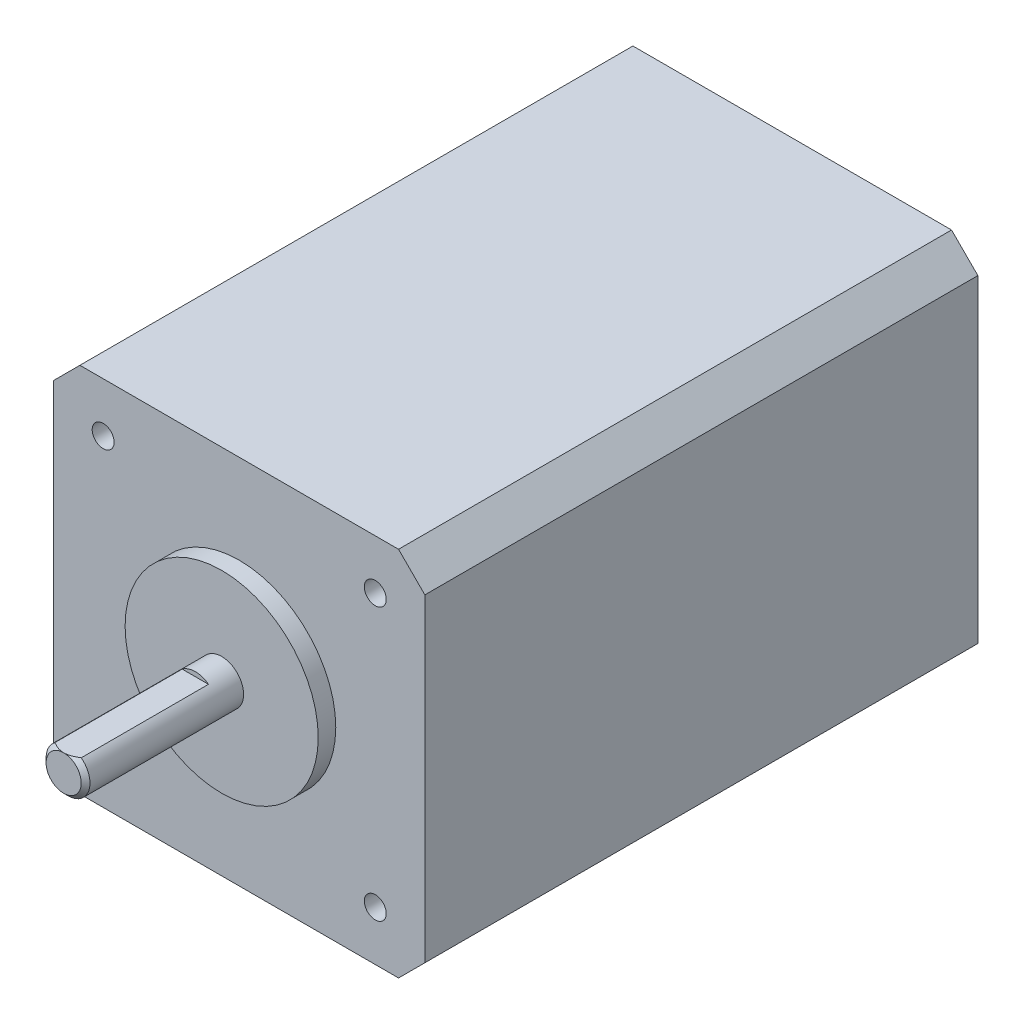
ISO-10303-21;
HEADER;
FILE_DESCRIPTION(('STEP AP214'),'2;1');
FILE_NAME('part.step','',(''),(''),'','','');
FILE_SCHEMA(('AUTOMOTIVE_DESIGN { 1 0 10303 214 1 1 1 1 }'));
ENDSEC;
DATA;
#1=APPLICATION_CONTEXT('core data for automotive mechanical design processes');
#2=APPLICATION_PROTOCOL_DEFINITION('international standard','automotive_design',2000,#1);
#3=PRODUCT_CONTEXT('',#1,'mechanical');
#4=PRODUCT('Part','Part','',(#3));
#5=PRODUCT_RELATED_PRODUCT_CATEGORY('part','',(#4));
#6=PRODUCT_DEFINITION_FORMATION('','',#4);
#7=PRODUCT_DEFINITION_CONTEXT('part definition',#1,'design');
#8=PRODUCT_DEFINITION('design','',#6,#7);
#9=PRODUCT_DEFINITION_SHAPE('','',#8);
#10=(LENGTH_UNIT() NAMED_UNIT(*) SI_UNIT(.MILLI.,.METRE.));
#11=(NAMED_UNIT(*) PLANE_ANGLE_UNIT() SI_UNIT($,.RADIAN.));
#12=(NAMED_UNIT(*) SI_UNIT($,.STERADIAN.) SOLID_ANGLE_UNIT());
#13=UNCERTAINTY_MEASURE_WITH_UNIT(LENGTH_MEASURE(1.E-05),#10,'distance_accuracy_value','');
#14=(GEOMETRIC_REPRESENTATION_CONTEXT(3) GLOBAL_UNCERTAINTY_ASSIGNED_CONTEXT((#13)) GLOBAL_UNIT_ASSIGNED_CONTEXT((#10,
#11,#12)) REPRESENTATION_CONTEXT('',''));
#15=CARTESIAN_POINT('',(0.,0.,0.));
#16=DIRECTION('',(0.,0.,1.));
#17=DIRECTION('',(1.,0.,0.));
#18=AXIS2_PLACEMENT_3D('',#15,#16,#17);
#19=CARTESIAN_POINT('',(0.,0.,0.));
#20=DIRECTION('',(0.,0.,1.));
#21=DIRECTION('',(1.,0.,0.));
#22=AXIS2_PLACEMENT_3D('',#19,#20,#21);
#23=PLANE('',#22);
#24=CARTESIAN_POINT('',(0.,0.,0.));
#25=DIRECTION('',(0.,0.,1.));
#26=DIRECTION('',(1.,0.,0.));
#27=AXIS2_PLACEMENT_3D('',#24,#25,#26);
#28=CIRCLE('',#27,11.);
#29=CARTESIAN_POINT('',(11.,0.,0.));
#30=VERTEX_POINT('',#29);
#31=EDGE_CURVE('E230',#30,#30,#28,.T.);
#32=ORIENTED_EDGE('',*,*,#31,.T.);
#33=EDGE_LOOP('',(#32));
#34=FACE_BOUND('',#33,.T.);
#35=CARTESIAN_POINT('',(0.,0.,0.));
#36=DIRECTION('',(0.,0.,1.));
#37=DIRECTION('',(1.,0.,0.));
#38=AXIS2_PLACEMENT_3D('',#35,#36,#37);
#39=CIRCLE('',#38,2.5);
#40=CARTESIAN_POINT('',(2.5,0.,0.));
#41=VERTEX_POINT('',#40);
#42=EDGE_CURVE('E227',#41,#41,#39,.T.);
#43=ORIENTED_EDGE('',*,*,#42,.F.);
#44=EDGE_LOOP('',(#43));
#45=FACE_BOUND('',#44,.T.);
#46=ADVANCED_FACE('F37',(#34,#45),#23,.T.);
#47=CARTESIAN_POINT('',(0.,0.,-2.));
#48=DIRECTION('',(0.,0.,1.));
#49=DIRECTION('',(1.,0.,0.));
#50=AXIS2_PLACEMENT_3D('',#47,#48,#49);
#51=CYLINDRICAL_SURFACE('',#50,11.);
#52=CARTESIAN_POINT('',(0.,0.,-2.));
#53=DIRECTION('',(0.,0.,1.));
#54=DIRECTION('',(1.,0.,0.));
#55=AXIS2_PLACEMENT_3D('',#52,#53,#54);
#56=CIRCLE('',#55,11.);
#57=CARTESIAN_POINT('',(11.,0.,-2.));
#58=VERTEX_POINT('',#57);
#59=EDGE_CURVE('E217',#58,#58,#56,.F.);
#60=ORIENTED_EDGE('',*,*,#59,.F.);
#61=EDGE_LOOP('',(#60));
#62=FACE_BOUND('',#61,.T.);
#63=ORIENTED_EDGE('',*,*,#31,.F.);
#64=EDGE_LOOP('',(#63));
#65=FACE_BOUND('',#64,.T.);
#66=ADVANCED_FACE('F262',(#62,#65),#51,.T.);
#67=CARTESIAN_POINT('',(0.,0.,18.));
#68=DIRECTION('',(0.,0.,-1.));
#69=DIRECTION('',(-1.,0.,0.));
#70=AXIS2_PLACEMENT_3D('',#67,#68,#69);
#71=CYLINDRICAL_SURFACE('',#70,2.5);
#72=DIRECTION('',(0.,0.,-1.));
#73=VECTOR('',#72,1.);
#74=CARTESIAN_POINT('',(1.5,2.,18.));
#75=LINE('',#74,#73);
#76=CARTESIAN_POINT('',(1.5,2.,3.));
#77=VERTEX_POINT('',#76);
#78=CARTESIAN_POINT('',(1.5,2.,17.5));
#79=VERTEX_POINT('',#78);
#80=EDGE_CURVE('E223',#77,#79,#75,.F.);
#81=ORIENTED_EDGE('',*,*,#80,.T.);
#82=CARTESIAN_POINT('',(0.,0.,17.5));
#83=DIRECTION('',(0.,0.,1.));
#84=DIRECTION('',(1.,0.,0.));
#85=AXIS2_PLACEMENT_3D('',#82,#83,#84);
#86=CIRCLE('',#85,2.5);
#87=CARTESIAN_POINT('',(-1.5,2.,17.5));
#88=VERTEX_POINT('',#87);
#89=EDGE_CURVE('E11',#79,#88,#86,.F.);
#90=ORIENTED_EDGE('',*,*,#89,.T.);
#91=DIRECTION('',(0.,0.,-1.));
#92=VECTOR('',#91,1.);
#93=CARTESIAN_POINT('',(-1.5,2.,18.));
#94=LINE('',#93,#92);
#95=CARTESIAN_POINT('',(-1.5,2.,3.));
#96=VERTEX_POINT('',#95);
#97=EDGE_CURVE('E225',#88,#96,#94,.T.);
#98=ORIENTED_EDGE('',*,*,#97,.T.);
#99=CARTESIAN_POINT('',(0.,0.,3.));
#100=DIRECTION('',(0.,0.,1.));
#101=DIRECTION('',(1.,0.,0.));
#102=AXIS2_PLACEMENT_3D('',#99,#100,#101);
#103=CIRCLE('',#102,2.5);
#104=EDGE_CURVE('E233',#77,#96,#103,.T.);
#105=ORIENTED_EDGE('',*,*,#104,.F.);
#106=EDGE_LOOP('',(#81,#90,#98,#105));
#107=FACE_BOUND('',#106,.T.);
#108=ORIENTED_EDGE('',*,*,#42,.T.);
#109=EDGE_LOOP('',(#108));
#110=FACE_BOUND('',#109,.T.);
#111=ADVANCED_FACE('F258',(#107,#110),#71,.T.);
#112=CARTESIAN_POINT('',(0.,0.,18.));
#113=DIRECTION('',(0.,0.,1.));
#114=DIRECTION('',(1.,0.,0.));
#115=AXIS2_PLACEMENT_3D('',#112,#113,#114);
#116=PLANE('',#115);
#117=CARTESIAN_POINT('',(0.,0.,18.));
#118=DIRECTION('',(0.,0.,1.));
#119=DIRECTION('',(1.,0.,0.));
#120=AXIS2_PLACEMENT_3D('',#117,#118,#119);
#121=CIRCLE('',#120,2.00000000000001);
#122=CARTESIAN_POINT('',(0.,2.,18.));
#123=VERTEX_POINT('',#122);
#124=EDGE_CURVE('E236',#123,#123,#121,.T.);
#125=ORIENTED_EDGE('',*,*,#124,.T.);
#126=EDGE_LOOP('',(#125));
#127=FACE_BOUND('',#126,.T.);
#128=ADVANCED_FACE('F254',(#127),#116,.T.);
#129=CARTESIAN_POINT('',(0.,0.,3.));
#130=DIRECTION('',(0.,0.,1.));
#131=DIRECTION('',(1.,0.,0.));
#132=AXIS2_PLACEMENT_3D('',#129,#130,#131);
#133=PLANE('',#132);
#134=ORIENTED_EDGE('',*,*,#104,.T.);
#135=DIRECTION('',(1.,0.,0.));
#136=VECTOR('',#135,1.);
#137=CARTESIAN_POINT('',(-2.5,2.,3.));
#138=LINE('',#137,#136);
#139=EDGE_CURVE('E220',#96,#77,#138,.T.);
#140=ORIENTED_EDGE('',*,*,#139,.T.);
#141=EDGE_LOOP('',(#134,#140));
#142=FACE_BOUND('',#141,.T.);
#143=ADVANCED_FACE('F252',(#142),#133,.T.);
#144=CARTESIAN_POINT('',(0.,2.,3.));
#145=DIRECTION('',(0.,-1.,0.));
#146=DIRECTION('',(0.,0.,-1.));
#147=AXIS2_PLACEMENT_3D('',#144,#145,#146);
#148=PLANE('',#147);
#149=CARTESIAN_POINT('',(-1.5,2.,17.5));
#150=CARTESIAN_POINT('',(-1.42763018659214,2.,17.5433736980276));
#151=CARTESIAN_POINT('',(-1.35436226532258,2.,17.5853687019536));
#152=CARTESIAN_POINT('',(-1.20549660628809,2.,17.6656443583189));
#153=CARTESIAN_POINT('',(-1.12989157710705,2.,17.7039114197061));
#154=CARTESIAN_POINT('',(-0.978296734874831,2.,17.774534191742));
#155=CARTESIAN_POINT('',(-0.902366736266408,2.,17.8070165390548));
#156=CARTESIAN_POINT('',(-0.748220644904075,2.,17.8658090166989));
#157=CARTESIAN_POINT('',(-0.670007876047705,2.,17.8921276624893));
#158=CARTESIAN_POINT('',(-0.543060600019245,2.,17.9280861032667));
#159=CARTESIAN_POINT('',(-0.495021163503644,2.,17.9401901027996));
#160=CARTESIAN_POINT('',(-0.398260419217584,2.,17.9612794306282));
#161=CARTESIAN_POINT('',(-0.349539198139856,2.,17.9702651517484));
#162=CARTESIAN_POINT('',(-0.250852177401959,2.,17.984927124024));
#163=CARTESIAN_POINT('',(-0.20087865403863,2.,17.9905520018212));
#164=CARTESIAN_POINT('',(-0.100607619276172,2.,17.9981023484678));
#165=CARTESIAN_POINT('',(-0.0503098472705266,2.,18.0000243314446));
#166=CARTESIAN_POINT('',(0.,2.,18.));
#167=B_SPLINE_CURVE_WITH_KNOTS('',3,(#149,#150,#151,#152,#153,#154,#155,#156,#157,#158,#159,
#160,#161,#162,#163,#164,#165,#166),.UNSPECIFIED.,.F.,.F.,(4,2,2,2,2,2,2,2,4),(0.,
0.253195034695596,0.507281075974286,0.754837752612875,1.00205037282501,1.15058504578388,
1.29910100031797,1.44983263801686,1.600706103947),.UNSPECIFIED.);
#168=EDGE_CURVE('E239',#88,#123,#167,.T.);
#169=ORIENTED_EDGE('',*,*,#168,.T.);
#170=CARTESIAN_POINT('',(0.,2.00000000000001,18.));
#171=CARTESIAN_POINT('',(0.0614966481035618,2.,18.0000514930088));
#172=CARTESIAN_POINT('',(0.122961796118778,2.,17.997164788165));
#173=CARTESIAN_POINT('',(0.245274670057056,2.,17.9859212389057));
#174=CARTESIAN_POINT('',(0.306123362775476,2.,17.9775750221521));
#175=CARTESIAN_POINT('',(0.425885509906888,2.,17.9559969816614));
#176=CARTESIAN_POINT('',(0.484814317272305,2.,17.9428488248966));
#177=CARTESIAN_POINT('',(0.601555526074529,2.,17.9122507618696));
#178=CARTESIAN_POINT('',(0.659367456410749,2.,17.8947990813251));
#179=CARTESIAN_POINT('',(0.784576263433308,2.,17.8525702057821));
#180=CARTESIAN_POINT('',(0.851714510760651,2.,17.8270315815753));
#181=CARTESIAN_POINT('',(0.984250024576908,2.,17.7717452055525));
#182=CARTESIAN_POINT('',(1.04964642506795,2.,17.7419954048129));
#183=CARTESIAN_POINT('',(1.18016546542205,2.,17.6784785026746));
#184=CARTESIAN_POINT('',(1.24525271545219,2.,17.6446394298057));
#185=CARTESIAN_POINT('',(1.37378197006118,2.,17.5742160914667));
#186=CARTESIAN_POINT('',(1.43722666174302,2.,17.5376367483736));
#187=CARTESIAN_POINT('',(1.5,2.,17.5));
#188=B_SPLINE_CURVE_WITH_KNOTS('',3,(#170,#171,#172,#173,#174,#175,#176,#177,#178,#179,#180,
#181,#182,#183,#184,#185,#186,#187),.UNSPECIFIED.,.F.,.F.,(4,2,2,2,2,2,2,2,4),(0.,
0.184371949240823,0.368386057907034,0.549336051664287,0.730360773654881,0.945674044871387,
1.16109243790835,1.38109142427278,1.60070428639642),.UNSPECIFIED.);
#189=EDGE_CURVE('E46',#123,#79,#188,.T.);
#190=ORIENTED_EDGE('',*,*,#189,.T.);
#191=ORIENTED_EDGE('',*,*,#80,.F.);
#192=ORIENTED_EDGE('',*,*,#139,.F.);
#193=ORIENTED_EDGE('',*,*,#97,.F.);
#194=EDGE_LOOP('',(#169,#190,#191,#192,#193));
#195=FACE_BOUND('',#194,.T.);
#196=ADVANCED_FACE('F247',(#195),#148,.F.);
#197=CARTESIAN_POINT('',(0.,0.,18.));
#198=DIRECTION('',(0.,0.,-1.));
#199=DIRECTION('',(-1.,0.,0.));
#200=AXIS2_PLACEMENT_3D('',#197,#198,#199);
#201=CONICAL_SURFACE('',#200,2.00000000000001,0.785398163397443);
#202=ORIENTED_EDGE('',*,*,#168,.F.);
#203=ORIENTED_EDGE('',*,*,#89,.F.);
#204=ORIENTED_EDGE('',*,*,#189,.F.);
#205=ORIENTED_EDGE('',*,*,#124,.F.);
#206=EDGE_LOOP('',(#202,#203,#204,#205));
#207=FACE_BOUND('',#206,.T.);
#208=ADVANCED_FACE('F39',(#207),#201,.T.);
#209=CARTESIAN_POINT('',(21.15,-18.15,-65.));
#210=DIRECTION('',(-1.,0.,0.));
#211=DIRECTION('',(0.,0.,1.));
#212=AXIS2_PLACEMENT_3D('',#209,#210,#211);
#213=PLANE('',#212);
#214=DIRECTION('',(0.,-1.,0.));
#215=VECTOR('',#214,1.);
#216=CARTESIAN_POINT('',(21.15,-18.15,-2.));
#217=LINE('',#216,#215);
#218=CARTESIAN_POINT('',(21.15,18.15,-2.));
#219=VERTEX_POINT('',#218);
#220=CARTESIAN_POINT('',(21.15,-18.15,-2.));
#221=VERTEX_POINT('',#220);
#222=EDGE_CURVE('E158',#219,#221,#217,.T.);
#223=ORIENTED_EDGE('',*,*,#222,.T.);
#224=DIRECTION('',(0.,0.,1.));
#225=VECTOR('',#224,1.);
#226=CARTESIAN_POINT('',(21.15,-18.15,-65.));
#227=LINE('',#226,#225);
#228=CARTESIAN_POINT('',(21.15,-18.15,-65.));
#229=VERTEX_POINT('',#228);
#230=EDGE_CURVE('E214',#229,#221,#227,.T.);
#231=ORIENTED_EDGE('',*,*,#230,.F.);
#232=DIRECTION('',(0.,-1.,0.));
#233=VECTOR('',#232,1.);
#234=CARTESIAN_POINT('',(21.15,-18.15,-65.));
#235=LINE('',#234,#233);
#236=CARTESIAN_POINT('',(21.15,18.15,-65.));
#237=VERTEX_POINT('',#236);
#238=EDGE_CURVE('E159',#237,#229,#235,.T.);
#239=ORIENTED_EDGE('',*,*,#238,.F.);
#240=DIRECTION('',(0.,0.,1.));
#241=VECTOR('',#240,1.);
#242=CARTESIAN_POINT('',(21.15,18.15,-65.));
#243=LINE('',#242,#241);
#244=EDGE_CURVE('E177',#237,#219,#243,.T.);
#245=ORIENTED_EDGE('',*,*,#244,.T.);
#246=EDGE_LOOP('',(#223,#231,#239,#245));
#247=FACE_BOUND('',#246,.T.);
#248=ADVANCED_FACE('F288',(#247),#213,.F.);
#249=CARTESIAN_POINT('',(18.15,-21.15,-65.));
#250=DIRECTION('',(-0.707106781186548,0.707106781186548,0.));
#251=DIRECTION('',(-0.707106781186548,-0.707106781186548,0.));
#252=AXIS2_PLACEMENT_3D('',#249,#250,#251);
#253=PLANE('',#252);
#254=DIRECTION('',(-0.707106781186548,-0.707106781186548,0.));
#255=VECTOR('',#254,1.);
#256=CARTESIAN_POINT('',(18.15,-21.15,-2.));
#257=LINE('',#256,#255);
#258=CARTESIAN_POINT('',(18.15,-21.15,-2.));
#259=VERTEX_POINT('',#258);
#260=EDGE_CURVE('E180',#221,#259,#257,.T.);
#261=ORIENTED_EDGE('',*,*,#260,.T.);
#262=DIRECTION('',(0.,0.,1.));
#263=VECTOR('',#262,1.);
#264=CARTESIAN_POINT('',(18.15,-21.15,-65.));
#265=LINE('',#264,#263);
#266=CARTESIAN_POINT('',(18.15,-21.15,-65.));
#267=VERTEX_POINT('',#266);
#268=EDGE_CURVE('E211',#267,#259,#265,.T.);
#269=ORIENTED_EDGE('',*,*,#268,.F.);
#270=DIRECTION('',(-0.707106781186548,-0.707106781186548,0.));
#271=VECTOR('',#270,1.);
#272=CARTESIAN_POINT('',(18.15,-21.15,-65.));
#273=LINE('',#272,#271);
#274=EDGE_CURVE('E162',#229,#267,#273,.T.);
#275=ORIENTED_EDGE('',*,*,#274,.F.);
#276=ORIENTED_EDGE('',*,*,#230,.T.);
#277=EDGE_LOOP('',(#261,#269,#275,#276));
#278=FACE_BOUND('',#277,.T.);
#279=ADVANCED_FACE('F319',(#278),#253,.F.);
#280=CARTESIAN_POINT('',(-18.15,-21.15,-65.));
#281=DIRECTION('',(0.,1.,0.));
#282=DIRECTION('',(-1.,0.,0.));
#283=AXIS2_PLACEMENT_3D('',#280,#281,#282);
#284=PLANE('',#283);
#285=DIRECTION('',(-1.,0.,0.));
#286=VECTOR('',#285,1.);
#287=CARTESIAN_POINT('',(-18.15,-21.15,-2.));
#288=LINE('',#287,#286);
#289=CARTESIAN_POINT('',(-18.15,-21.15,-2.));
#290=VERTEX_POINT('',#289);
#291=EDGE_CURVE('E182',#259,#290,#288,.T.);
#292=ORIENTED_EDGE('',*,*,#291,.T.);
#293=DIRECTION('',(0.,0.,1.));
#294=VECTOR('',#293,1.);
#295=CARTESIAN_POINT('',(-18.15,-21.15,-65.));
#296=LINE('',#295,#294);
#297=CARTESIAN_POINT('',(-18.15,-21.15,-65.));
#298=VERTEX_POINT('',#297);
#299=EDGE_CURVE('E208',#298,#290,#296,.T.);
#300=ORIENTED_EDGE('',*,*,#299,.F.);
#301=DIRECTION('',(-1.,0.,0.));
#302=VECTOR('',#301,1.);
#303=CARTESIAN_POINT('',(-18.15,-21.15,-65.));
#304=LINE('',#303,#302);
#305=EDGE_CURVE('E165',#267,#298,#304,.T.);
#306=ORIENTED_EDGE('',*,*,#305,.F.);
#307=ORIENTED_EDGE('',*,*,#268,.T.);
#308=EDGE_LOOP('',(#292,#300,#306,#307));
#309=FACE_BOUND('',#308,.T.);
#310=ADVANCED_FACE('F316',(#309),#284,.F.);
#311=CARTESIAN_POINT('',(-21.15,-18.15,-65.));
#312=DIRECTION('',(0.707106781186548,0.707106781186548,0.));
#313=DIRECTION('',(-0.707106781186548,0.707106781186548,0.));
#314=AXIS2_PLACEMENT_3D('',#311,#312,#313);
#315=PLANE('',#314);
#316=DIRECTION('',(-0.707106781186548,0.707106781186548,0.));
#317=VECTOR('',#316,1.);
#318=CARTESIAN_POINT('',(-21.15,-18.15,-2.));
#319=LINE('',#318,#317);
#320=CARTESIAN_POINT('',(-21.15,-18.15,-2.));
#321=VERTEX_POINT('',#320);
#322=EDGE_CURVE('E184',#290,#321,#319,.T.);
#323=ORIENTED_EDGE('',*,*,#322,.T.);
#324=DIRECTION('',(0.,0.,1.));
#325=VECTOR('',#324,1.);
#326=CARTESIAN_POINT('',(-21.15,-18.15,-65.));
#327=LINE('',#326,#325);
#328=CARTESIAN_POINT('',(-21.15,-18.15,-65.));
#329=VERTEX_POINT('',#328);
#330=EDGE_CURVE('E205',#329,#321,#327,.T.);
#331=ORIENTED_EDGE('',*,*,#330,.F.);
#332=DIRECTION('',(-0.707106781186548,0.707106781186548,0.));
#333=VECTOR('',#332,1.);
#334=CARTESIAN_POINT('',(-21.15,-18.15,-65.));
#335=LINE('',#334,#333);
#336=EDGE_CURVE('E167',#298,#329,#335,.T.);
#337=ORIENTED_EDGE('',*,*,#336,.F.);
#338=ORIENTED_EDGE('',*,*,#299,.T.);
#339=EDGE_LOOP('',(#323,#331,#337,#338));
#340=FACE_BOUND('',#339,.T.);
#341=ADVANCED_FACE('F311',(#340),#315,.F.);
#342=CARTESIAN_POINT('',(-21.15,18.15,-65.));
#343=DIRECTION('',(1.,0.,0.));
#344=DIRECTION('',(0.,1.,0.));
#345=AXIS2_PLACEMENT_3D('',#342,#343,#344);
#346=PLANE('',#345);
#347=DIRECTION('',(0.,1.,0.));
#348=VECTOR('',#347,1.);
#349=CARTESIAN_POINT('',(-21.15,18.15,-2.));
#350=LINE('',#349,#348);
#351=CARTESIAN_POINT('',(-21.15,18.15,-2.));
#352=VERTEX_POINT('',#351);
#353=EDGE_CURVE('E186',#321,#352,#350,.T.);
#354=ORIENTED_EDGE('',*,*,#353,.T.);
#355=DIRECTION('',(0.,0.,1.));
#356=VECTOR('',#355,1.);
#357=CARTESIAN_POINT('',(-21.15,18.15,-65.));
#358=LINE('',#357,#356);
#359=CARTESIAN_POINT('',(-21.15,18.15,-65.));
#360=VERTEX_POINT('',#359);
#361=EDGE_CURVE('E202',#360,#352,#358,.T.);
#362=ORIENTED_EDGE('',*,*,#361,.F.);
#363=DIRECTION('',(0.,1.,0.));
#364=VECTOR('',#363,1.);
#365=CARTESIAN_POINT('',(-21.15,18.15,-65.));
#366=LINE('',#365,#364);
#367=EDGE_CURVE('E169',#329,#360,#366,.T.);
#368=ORIENTED_EDGE('',*,*,#367,.F.);
#369=ORIENTED_EDGE('',*,*,#330,.T.);
#370=EDGE_LOOP('',(#354,#362,#368,#369));
#371=FACE_BOUND('',#370,.T.);
#372=ADVANCED_FACE('F307',(#371),#346,.F.);
#373=CARTESIAN_POINT('',(-18.15,21.15,-65.));
#374=DIRECTION('',(0.707106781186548,-0.707106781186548,0.));
#375=DIRECTION('',(0.707106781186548,0.707106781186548,0.));
#376=AXIS2_PLACEMENT_3D('',#373,#374,#375);
#377=PLANE('',#376);
#378=DIRECTION('',(0.707106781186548,0.707106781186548,0.));
#379=VECTOR('',#378,1.);
#380=CARTESIAN_POINT('',(-18.15,21.15,-2.));
#381=LINE('',#380,#379);
#382=CARTESIAN_POINT('',(-18.15,21.15,-2.));
#383=VERTEX_POINT('',#382);
#384=EDGE_CURVE('E188',#352,#383,#381,.T.);
#385=ORIENTED_EDGE('',*,*,#384,.T.);
#386=DIRECTION('',(0.,0.,1.));
#387=VECTOR('',#386,1.);
#388=CARTESIAN_POINT('',(-18.15,21.15,-65.));
#389=LINE('',#388,#387);
#390=CARTESIAN_POINT('',(-18.15,21.15,-65.));
#391=VERTEX_POINT('',#390);
#392=EDGE_CURVE('E199',#391,#383,#389,.T.);
#393=ORIENTED_EDGE('',*,*,#392,.F.);
#394=DIRECTION('',(0.707106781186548,0.707106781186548,0.));
#395=VECTOR('',#394,1.);
#396=CARTESIAN_POINT('',(-18.15,21.15,-65.));
#397=LINE('',#396,#395);
#398=EDGE_CURVE('E171',#360,#391,#397,.T.);
#399=ORIENTED_EDGE('',*,*,#398,.F.);
#400=ORIENTED_EDGE('',*,*,#361,.T.);
#401=EDGE_LOOP('',(#385,#393,#399,#400));
#402=FACE_BOUND('',#401,.T.);
#403=ADVANCED_FACE('F302',(#402),#377,.F.);
#404=CARTESIAN_POINT('',(18.15,21.15,-65.));
#405=DIRECTION('',(0.,-1.,0.));
#406=DIRECTION('',(0.,0.,-1.));
#407=AXIS2_PLACEMENT_3D('',#404,#405,#406);
#408=PLANE('',#407);
#409=DIRECTION('',(1.,0.,0.));
#410=VECTOR('',#409,1.);
#411=CARTESIAN_POINT('',(18.15,21.15,-2.));
#412=LINE('',#411,#410);
#413=CARTESIAN_POINT('',(18.15,21.15,-2.));
#414=VERTEX_POINT('',#413);
#415=EDGE_CURVE('E191',#383,#414,#412,.T.);
#416=ORIENTED_EDGE('',*,*,#415,.T.);
#417=DIRECTION('',(0.,0.,1.));
#418=VECTOR('',#417,1.);
#419=CARTESIAN_POINT('',(18.15,21.15,-65.));
#420=LINE('',#419,#418);
#421=CARTESIAN_POINT('',(18.15,21.15,-65.));
#422=VERTEX_POINT('',#421);
#423=EDGE_CURVE('E196',#422,#414,#420,.T.);
#424=ORIENTED_EDGE('',*,*,#423,.F.);
#425=DIRECTION('',(1.,0.,0.));
#426=VECTOR('',#425,1.);
#427=CARTESIAN_POINT('',(0.,21.15,-65.));
#428=LINE('',#427,#426);
#429=EDGE_CURVE('E173',#391,#422,#428,.T.);
#430=ORIENTED_EDGE('',*,*,#429,.F.);
#431=ORIENTED_EDGE('',*,*,#392,.T.);
#432=EDGE_LOOP('',(#416,#424,#430,#431));
#433=FACE_BOUND('',#432,.T.);
#434=ADVANCED_FACE('F297',(#433),#408,.F.);
#435=CARTESIAN_POINT('',(21.15,18.15,-65.));
#436=DIRECTION('',(-0.707106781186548,-0.707106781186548,0.));
#437=DIRECTION('',(0.707106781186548,-0.707106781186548,0.));
#438=AXIS2_PLACEMENT_3D('',#435,#436,#437);
#439=PLANE('',#438);
#440=DIRECTION('',(0.707106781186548,-0.707106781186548,0.));
#441=VECTOR('',#440,1.);
#442=CARTESIAN_POINT('',(21.15,18.15,-2.));
#443=LINE('',#442,#441);
#444=EDGE_CURVE('E163',#414,#219,#443,.T.);
#445=ORIENTED_EDGE('',*,*,#444,.T.);
#446=ORIENTED_EDGE('',*,*,#244,.F.);
#447=DIRECTION('',(0.707106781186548,-0.707106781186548,0.));
#448=VECTOR('',#447,1.);
#449=CARTESIAN_POINT('',(21.15,18.15,-65.));
#450=LINE('',#449,#448);
#451=EDGE_CURVE('E175',#422,#237,#450,.T.);
#452=ORIENTED_EDGE('',*,*,#451,.F.);
#453=ORIENTED_EDGE('',*,*,#423,.T.);
#454=EDGE_LOOP('',(#445,#446,#452,#453));
#455=FACE_BOUND('',#454,.T.);
#456=ADVANCED_FACE('F293',(#455),#439,.F.);
#457=CARTESIAN_POINT('',(0.,0.,-65.));
#458=DIRECTION('',(0.,0.,1.));
#459=DIRECTION('',(1.,0.,0.));
#460=AXIS2_PLACEMENT_3D('',#457,#458,#459);
#461=PLANE('',#460);
#462=ORIENTED_EDGE('',*,*,#238,.T.);
#463=ORIENTED_EDGE('',*,*,#274,.T.);
#464=ORIENTED_EDGE('',*,*,#305,.T.);
#465=ORIENTED_EDGE('',*,*,#336,.T.);
#466=ORIENTED_EDGE('',*,*,#367,.T.);
#467=ORIENTED_EDGE('',*,*,#398,.T.);
#468=ORIENTED_EDGE('',*,*,#429,.T.);
#469=ORIENTED_EDGE('',*,*,#451,.T.);
#470=EDGE_LOOP('',(#462,#463,#464,#465,#466,#467,#468,#469));
#471=FACE_BOUND('',#470,.T.);
#472=ADVANCED_FACE('F280',(#471),#461,.F.);
#473=CARTESIAN_POINT('',(0.,0.,-2.));
#474=DIRECTION('',(0.,0.,1.));
#475=DIRECTION('',(1.,0.,0.));
#476=AXIS2_PLACEMENT_3D('',#473,#474,#475);
#477=PLANE('',#476);
#478=CARTESIAN_POINT('',(-15.5,15.5,-2.));
#479=DIRECTION('',(0.,0.,1.));
#480=DIRECTION('',(1.,0.,0.));
#481=AXIS2_PLACEMENT_3D('',#478,#479,#480);
#482=CIRCLE('',#481,1.24999999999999);
#483=CARTESIAN_POINT('',(-14.25,15.5,-2.));
#484=VERTEX_POINT('',#483);
#485=EDGE_CURVE('E136',#484,#484,#482,.T.);
#486=ORIENTED_EDGE('',*,*,#485,.F.);
#487=EDGE_LOOP('',(#486));
#488=FACE_BOUND('',#487,.T.);
#489=CARTESIAN_POINT('',(15.5,15.5,-2.));
#490=DIRECTION('',(0.,0.,1.));
#491=DIRECTION('',(1.,0.,0.));
#492=AXIS2_PLACEMENT_3D('',#489,#490,#491);
#493=CIRCLE('',#492,1.24999999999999);
#494=CARTESIAN_POINT('',(16.75,15.5,-2.));
#495=VERTEX_POINT('',#494);
#496=EDGE_CURVE('E135',#495,#495,#493,.T.);
#497=ORIENTED_EDGE('',*,*,#496,.F.);
#498=EDGE_LOOP('',(#497));
#499=FACE_BOUND('',#498,.T.);
#500=CARTESIAN_POINT('',(15.5,-15.5,-2.));
#501=DIRECTION('',(0.,0.,1.));
#502=DIRECTION('',(1.,0.,0.));
#503=AXIS2_PLACEMENT_3D('',#500,#501,#502);
#504=CIRCLE('',#503,1.24999999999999);
#505=CARTESIAN_POINT('',(16.75,-15.5,-2.));
#506=VERTEX_POINT('',#505);
#507=EDGE_CURVE('E146',#506,#506,#504,.T.);
#508=ORIENTED_EDGE('',*,*,#507,.F.);
#509=EDGE_LOOP('',(#508));
#510=FACE_BOUND('',#509,.T.);
#511=CARTESIAN_POINT('',(-15.5,-15.5,-2.));
#512=DIRECTION('',(0.,0.,1.));
#513=DIRECTION('',(1.,0.,0.));
#514=AXIS2_PLACEMENT_3D('',#511,#512,#513);
#515=CIRCLE('',#514,1.24999999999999);
#516=CARTESIAN_POINT('',(-14.25,-15.5,-2.));
#517=VERTEX_POINT('',#516);
#518=EDGE_CURVE('E152',#517,#517,#515,.T.);
#519=ORIENTED_EDGE('',*,*,#518,.F.);
#520=EDGE_LOOP('',(#519));
#521=FACE_BOUND('',#520,.T.);
#522=ORIENTED_EDGE('',*,*,#59,.T.);
#523=EDGE_LOOP('',(#522));
#524=FACE_BOUND('',#523,.T.);
#525=ORIENTED_EDGE('',*,*,#222,.F.);
#526=ORIENTED_EDGE('',*,*,#444,.F.);
#527=ORIENTED_EDGE('',*,*,#415,.F.);
#528=ORIENTED_EDGE('',*,*,#384,.F.);
#529=ORIENTED_EDGE('',*,*,#353,.F.);
#530=ORIENTED_EDGE('',*,*,#322,.F.);
#531=ORIENTED_EDGE('',*,*,#291,.F.);
#532=ORIENTED_EDGE('',*,*,#260,.F.);
#533=EDGE_LOOP('',(#525,#526,#527,#528,#529,#530,#531,#532));
#534=FACE_BOUND('',#533,.T.);
#535=ADVANCED_FACE('F276',(#488,#499,#510,#521,#524,#534),#477,.T.);
#536=CARTESIAN_POINT('',(-15.5,-15.5,-9.));
#537=DIRECTION('',(0.,0.,1.));
#538=DIRECTION('',(1.,0.,0.));
#539=AXIS2_PLACEMENT_3D('',#536,#537,#538);
#540=CONICAL_SURFACE('',#539,1.25,1.02974425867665);
#541=CARTESIAN_POINT('',(-15.5,-15.5,-9.75107577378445));
#542=VERTEX_POINT('',#541);
#543=VERTEX_LOOP('',#542);
#544=FACE_BOUND('',#543,.T.);
#545=CARTESIAN_POINT('',(-15.5,-15.5,-9.));
#546=DIRECTION('',(0.,0.,1.));
#547=DIRECTION('',(1.,0.,0.));
#548=AXIS2_PLACEMENT_3D('',#545,#546,#547);
#549=CIRCLE('',#548,1.25);
#550=CARTESIAN_POINT('',(-14.25,-15.5,-9.));
#551=VERTEX_POINT('',#550);
#552=EDGE_CURVE('E155',#551,#551,#549,.T.);
#553=ORIENTED_EDGE('',*,*,#552,.T.);
#554=EDGE_LOOP('',(#553));
#555=FACE_BOUND('',#554,.T.);
#556=ADVANCED_FACE('F279',(#544,#555),#540,.F.);
#557=CARTESIAN_POINT('',(-15.5,-15.5,-2.));
#558=DIRECTION('',(0.,0.,1.));
#559=DIRECTION('',(1.,0.,0.));
#560=AXIS2_PLACEMENT_3D('',#557,#558,#559);
#561=CYLINDRICAL_SURFACE('',#560,1.24999999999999);
#562=ORIENTED_EDGE('',*,*,#552,.F.);
#563=EDGE_LOOP('',(#562));
#564=FACE_BOUND('',#563,.T.);
#565=ORIENTED_EDGE('',*,*,#518,.T.);
#566=EDGE_LOOP('',(#565));
#567=FACE_BOUND('',#566,.T.);
#568=ADVANCED_FACE('F437',(#564,#567),#561,.F.);
#569=CARTESIAN_POINT('',(15.5,-15.5,-9.));
#570=DIRECTION('',(0.,0.,1.));
#571=DIRECTION('',(1.,0.,0.));
#572=AXIS2_PLACEMENT_3D('',#569,#570,#571);
#573=CONICAL_SURFACE('',#572,1.25,1.02974425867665);
#574=CARTESIAN_POINT('',(15.5,-15.5,-9.75107577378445));
#575=VERTEX_POINT('',#574);
#576=VERTEX_LOOP('',#575);
#577=FACE_BOUND('',#576,.T.);
#578=CARTESIAN_POINT('',(15.5,-15.5,-9.));
#579=DIRECTION('',(0.,0.,1.));
#580=DIRECTION('',(1.,0.,0.));
#581=AXIS2_PLACEMENT_3D('',#578,#579,#580);
#582=CIRCLE('',#581,1.25);
#583=CARTESIAN_POINT('',(16.75,-15.5,-9.));
#584=VERTEX_POINT('',#583);
#585=EDGE_CURVE('E149',#584,#584,#582,.T.);
#586=ORIENTED_EDGE('',*,*,#585,.T.);
#587=EDGE_LOOP('',(#586));
#588=FACE_BOUND('',#587,.T.);
#589=ADVANCED_FACE('F447',(#577,#588),#573,.F.);
#590=CARTESIAN_POINT('',(15.5,-15.5,-2.));
#591=DIRECTION('',(0.,0.,1.));
#592=DIRECTION('',(1.,0.,0.));
#593=AXIS2_PLACEMENT_3D('',#590,#591,#592);
#594=CYLINDRICAL_SURFACE('',#593,1.24999999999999);
#595=ORIENTED_EDGE('',*,*,#585,.F.);
#596=EDGE_LOOP('',(#595));
#597=FACE_BOUND('',#596,.T.);
#598=ORIENTED_EDGE('',*,*,#507,.T.);
#599=EDGE_LOOP('',(#598));
#600=FACE_BOUND('',#599,.T.);
#601=ADVANCED_FACE('F457',(#597,#600),#594,.F.);
#602=CARTESIAN_POINT('',(15.5,15.5,-9.));
#603=DIRECTION('',(0.,0.,1.));
#604=DIRECTION('',(1.,0.,0.));
#605=AXIS2_PLACEMENT_3D('',#602,#603,#604);
#606=CONICAL_SURFACE('',#605,1.25,1.02974425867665);
#607=CARTESIAN_POINT('',(15.5,15.5,-9.75107577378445));
#608=VERTEX_POINT('',#607);
#609=VERTEX_LOOP('',#608);
#610=FACE_BOUND('',#609,.T.);
#611=CARTESIAN_POINT('',(15.5,15.5,-9.));
#612=DIRECTION('',(0.,0.,1.));
#613=DIRECTION('',(1.,0.,0.));
#614=AXIS2_PLACEMENT_3D('',#611,#612,#613);
#615=CIRCLE('',#614,1.25);
#616=CARTESIAN_POINT('',(16.75,15.5,-9.));
#617=VERTEX_POINT('',#616);
#618=EDGE_CURVE('E139',#617,#617,#615,.T.);
#619=ORIENTED_EDGE('',*,*,#618,.T.);
#620=EDGE_LOOP('',(#619));
#621=FACE_BOUND('',#620,.T.);
#622=ADVANCED_FACE('F467',(#610,#621),#606,.F.);
#623=CARTESIAN_POINT('',(15.5,15.5,-2.));
#624=DIRECTION('',(0.,0.,1.));
#625=DIRECTION('',(1.,0.,0.));
#626=AXIS2_PLACEMENT_3D('',#623,#624,#625);
#627=CYLINDRICAL_SURFACE('',#626,1.24999999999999);
#628=ORIENTED_EDGE('',*,*,#618,.F.);
#629=EDGE_LOOP('',(#628));
#630=FACE_BOUND('',#629,.T.);
#631=ORIENTED_EDGE('',*,*,#496,.T.);
#632=EDGE_LOOP('',(#631));
#633=FACE_BOUND('',#632,.T.);
#634=ADVANCED_FACE('F129',(#630,#633),#627,.F.);
#635=CARTESIAN_POINT('',(-15.5,15.5,-9.));
#636=DIRECTION('',(0.,0.,1.));
#637=DIRECTION('',(1.,0.,0.));
#638=AXIS2_PLACEMENT_3D('',#635,#636,#637);
#639=CONICAL_SURFACE('',#638,1.25,1.02974425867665);
#640=CARTESIAN_POINT('',(-15.5,15.5,-9.75107577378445));
#641=VERTEX_POINT('',#640);
#642=VERTEX_LOOP('',#641);
#643=FACE_BOUND('',#642,.T.);
#644=CARTESIAN_POINT('',(-15.5,15.5,-9.));
#645=DIRECTION('',(0.,0.,1.));
#646=DIRECTION('',(1.,0.,0.));
#647=AXIS2_PLACEMENT_3D('',#644,#645,#646);
#648=CIRCLE('',#647,1.25);
#649=CARTESIAN_POINT('',(-14.25,15.5,-9.));
#650=VERTEX_POINT('',#649);
#651=EDGE_CURVE('E133',#650,#650,#648,.T.);
#652=ORIENTED_EDGE('',*,*,#651,.T.);
#653=EDGE_LOOP('',(#652));
#654=FACE_BOUND('',#653,.T.);
#655=ADVANCED_FACE('F125',(#643,#654),#639,.F.);
#656=CARTESIAN_POINT('',(-15.5,15.5,-2.));
#657=DIRECTION('',(0.,0.,1.));
#658=DIRECTION('',(1.,0.,0.));
#659=AXIS2_PLACEMENT_3D('',#656,#657,#658);
#660=CYLINDRICAL_SURFACE('',#659,1.24999999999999);
#661=ORIENTED_EDGE('',*,*,#651,.F.);
#662=EDGE_LOOP('',(#661));
#663=FACE_BOUND('',#662,.T.);
#664=ORIENTED_EDGE('',*,*,#485,.T.);
#665=EDGE_LOOP('',(#664));
#666=FACE_BOUND('',#665,.T.);
#667=ADVANCED_FACE('F128',(#663,#666),#660,.F.);
#668=CLOSED_SHELL('',(#46,#66,#111,#128,#143,#196,#208,#248,#279,#310,#341,#372,#403,#434,#456,
#472,#535,#556,#568,#589,#601,#622,#634,#655,#667));
#669=MANIFOLD_SOLID_BREP('B2',#668);
#670=ADVANCED_BREP_SHAPE_REPRESENTATION('',(#18,#669),#14);
#671=SHAPE_DEFINITION_REPRESENTATION(#9,#670);
ENDSEC;
END-ISO-10303-21;
